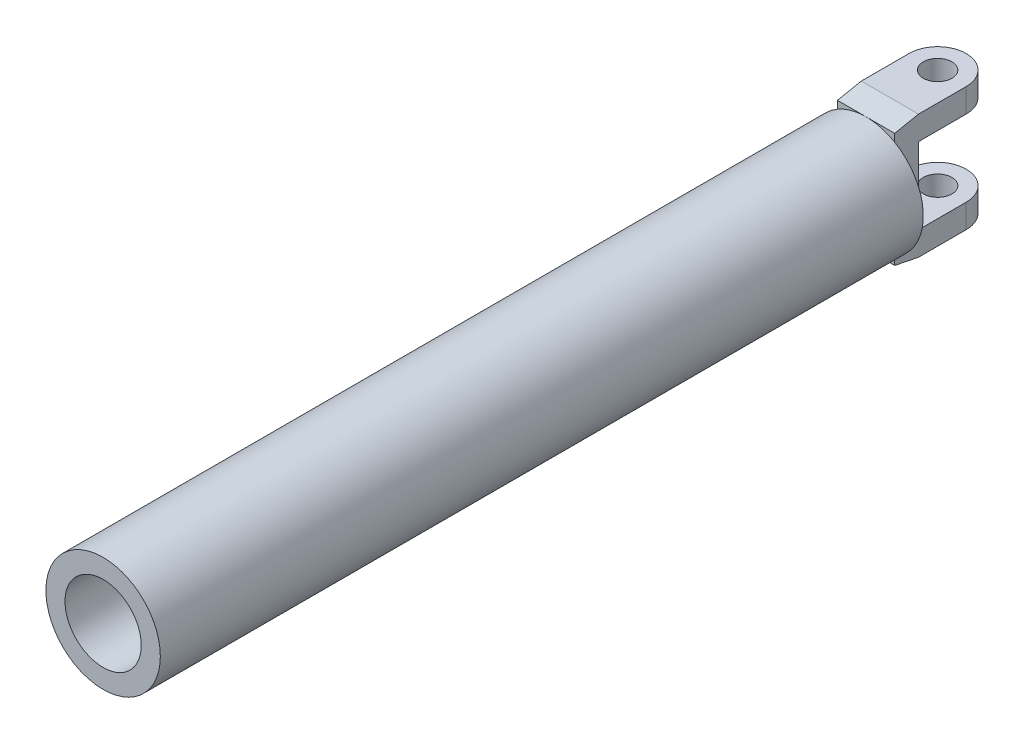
ISO-10303-21;
HEADER;
FILE_DESCRIPTION(('STEP AP214'),'2;1');
FILE_NAME('part.step','',(''),(''),'','','');
FILE_SCHEMA(('AUTOMOTIVE_DESIGN { 1 0 10303 214 1 1 1 1 }'));
ENDSEC;
DATA;
#1=APPLICATION_CONTEXT('core data for automotive mechanical design processes');
#2=APPLICATION_PROTOCOL_DEFINITION('international standard','automotive_design',2000,#1);
#3=PRODUCT_CONTEXT('',#1,'mechanical');
#4=PRODUCT('Part','Part','',(#3));
#5=PRODUCT_RELATED_PRODUCT_CATEGORY('part','',(#4));
#6=PRODUCT_DEFINITION_FORMATION('','',#4);
#7=PRODUCT_DEFINITION_CONTEXT('part definition',#1,'design');
#8=PRODUCT_DEFINITION('design','',#6,#7);
#9=PRODUCT_DEFINITION_SHAPE('','',#8);
#10=(LENGTH_UNIT() NAMED_UNIT(*) SI_UNIT(.MILLI.,.METRE.));
#11=(NAMED_UNIT(*) PLANE_ANGLE_UNIT() SI_UNIT($,.RADIAN.));
#12=(NAMED_UNIT(*) SI_UNIT($,.STERADIAN.) SOLID_ANGLE_UNIT());
#13=UNCERTAINTY_MEASURE_WITH_UNIT(LENGTH_MEASURE(1.E-05),#10,'distance_accuracy_value','');
#14=(GEOMETRIC_REPRESENTATION_CONTEXT(3) GLOBAL_UNCERTAINTY_ASSIGNED_CONTEXT((#13)) GLOBAL_UNIT_ASSIGNED_CONTEXT((#10,
#11,#12)) REPRESENTATION_CONTEXT('',''));
#15=CARTESIAN_POINT('',(0.,0.,0.));
#16=DIRECTION('',(0.,0.,1.));
#17=DIRECTION('',(1.,0.,0.));
#18=AXIS2_PLACEMENT_3D('',#15,#16,#17);
#19=CARTESIAN_POINT('',(0.,0.,0.));
#20=DIRECTION('',(0.,0.,1.));
#21=DIRECTION('',(1.,0.,0.));
#22=AXIS2_PLACEMENT_3D('',#19,#20,#21);
#23=PLANE('',#22);
#24=DIRECTION('',(0.,-1.,0.));
#25=VECTOR('',#24,1.);
#26=CARTESIAN_POINT('',(30.,-60.,0.));
#27=LINE('',#26,#25);
#28=CARTESIAN_POINT('',(30.,51.9615242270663,0.));
#29=VERTEX_POINT('',#28);
#30=CARTESIAN_POINT('',(30.,-51.9615242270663,0.));
#31=VERTEX_POINT('',#30);
#32=EDGE_CURVE('E173',#29,#31,#27,.T.);
#33=ORIENTED_EDGE('',*,*,#32,.F.);
#34=CARTESIAN_POINT('',(0.,0.,0.));
#35=DIRECTION('',(0.,0.,1.));
#36=DIRECTION('',(1.,0.,0.));
#37=AXIS2_PLACEMENT_3D('',#34,#35,#36);
#38=CIRCLE('',#37,60.);
#39=EDGE_CURVE('E188',#31,#29,#38,.T.);
#40=ORIENTED_EDGE('',*,*,#39,.F.);
#41=EDGE_LOOP('',(#33,#40));
#42=FACE_BOUND('',#41,.T.);
#43=ADVANCED_FACE('F41',(#42),#23,.F.);
#44=CARTESIAN_POINT('',(0.,0.,800.));
#45=DIRECTION('',(0.,0.,-1.));
#46=DIRECTION('',(-1.,0.,0.));
#47=AXIS2_PLACEMENT_3D('',#44,#45,#46);
#48=CYLINDRICAL_SURFACE('',#47,60.);
#49=CARTESIAN_POINT('',(0.,0.,800.));
#50=DIRECTION('',(0.,0.,1.));
#51=DIRECTION('',(1.,0.,0.));
#52=AXIS2_PLACEMENT_3D('',#49,#50,#51);
#53=CIRCLE('',#52,60.);
#54=CARTESIAN_POINT('',(60.,0.,800.));
#55=VERTEX_POINT('',#54);
#56=EDGE_CURVE('E197',#55,#55,#53,.T.);
#57=ORIENTED_EDGE('',*,*,#56,.F.);
#58=EDGE_LOOP('',(#57));
#59=FACE_BOUND('',#58,.T.);
#60=CARTESIAN_POINT('',(0.,60.,0.));
#61=VERTEX_POINT('',#60);
#62=EDGE_CURVE('E167',#29,#61,#38,.T.);
#63=ORIENTED_EDGE('',*,*,#62,.T.);
#64=CARTESIAN_POINT('',(-30.,51.9615242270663,0.));
#65=VERTEX_POINT('',#64);
#66=EDGE_CURVE('E200',#61,#65,#38,.T.);
#67=ORIENTED_EDGE('',*,*,#66,.T.);
#68=CARTESIAN_POINT('',(-30.,-51.9615242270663,0.));
#69=VERTEX_POINT('',#68);
#70=EDGE_CURVE('E372',#65,#69,#38,.T.);
#71=ORIENTED_EDGE('',*,*,#70,.T.);
#72=CARTESIAN_POINT('',(0.,-60.,0.));
#73=VERTEX_POINT('',#72);
#74=EDGE_CURVE('E322',#69,#73,#38,.T.);
#75=ORIENTED_EDGE('',*,*,#74,.T.);
#76=EDGE_CURVE('E191',#73,#31,#38,.T.);
#77=ORIENTED_EDGE('',*,*,#76,.T.);
#78=ORIENTED_EDGE('',*,*,#39,.T.);
#79=EDGE_LOOP('',(#63,#67,#71,#75,#77,#78));
#80=FACE_BOUND('',#79,.T.);
#81=ADVANCED_FACE('F373',(#59,#80),#48,.T.);
#82=CARTESIAN_POINT('',(0.,0.,800.));
#83=DIRECTION('',(0.,0.,1.));
#84=DIRECTION('',(1.,0.,0.));
#85=AXIS2_PLACEMENT_3D('',#82,#83,#84);
#86=PLANE('',#85);
#87=CARTESIAN_POINT('',(0.,0.,800.));
#88=DIRECTION('',(0.,0.,1.));
#89=DIRECTION('',(1.,0.,0.));
#90=AXIS2_PLACEMENT_3D('',#87,#88,#89);
#91=CIRCLE('',#90,40.);
#92=CARTESIAN_POINT('',(40.,0.,800.));
#93=VERTEX_POINT('',#92);
#94=EDGE_CURVE('E237',#93,#93,#91,.T.);
#95=ORIENTED_EDGE('',*,*,#94,.F.);
#96=EDGE_LOOP('',(#95));
#97=FACE_BOUND('',#96,.T.);
#98=ORIENTED_EDGE('',*,*,#56,.T.);
#99=EDGE_LOOP('',(#98));
#100=FACE_BOUND('',#99,.T.);
#101=ADVANCED_FACE('F375',(#97,#100),#86,.T.);
#102=ORIENTED_EDGE('',*,*,#70,.F.);
#103=DIRECTION('',(0.,-1.,0.));
#104=VECTOR('',#103,1.);
#105=CARTESIAN_POINT('',(-30.,-60.,0.));
#106=LINE('',#105,#104);
#107=EDGE_CURVE('E204',#65,#69,#106,.T.);
#108=ORIENTED_EDGE('',*,*,#107,.T.);
#109=EDGE_LOOP('',(#102,#108));
#110=FACE_BOUND('',#109,.T.);
#111=ADVANCED_FACE('F382',(#110),#23,.F.);
#112=CARTESIAN_POINT('',(30.,-60.,0.));
#113=DIRECTION('',(0.,0.,-1.));
#114=DIRECTION('',(-1.,0.,0.));
#115=AXIS2_PLACEMENT_3D('',#112,#113,#114);
#116=PLANE('',#115);
#117=ORIENTED_EDGE('',*,*,#62,.F.);
#118=CARTESIAN_POINT('',(30.,60.,0.));
#119=VERTEX_POINT('',#118);
#120=EDGE_CURVE('E162',#119,#29,#27,.T.);
#121=ORIENTED_EDGE('',*,*,#120,.F.);
#122=DIRECTION('',(-1.,0.,0.));
#123=VECTOR('',#122,1.);
#124=CARTESIAN_POINT('',(30.,60.,0.));
#125=LINE('',#124,#123);
#126=EDGE_CURVE('E166',#119,#61,#125,.T.);
#127=ORIENTED_EDGE('',*,*,#126,.T.);
#128=EDGE_LOOP('',(#117,#121,#127));
#129=FACE_BOUND('',#128,.T.);
#130=ADVANCED_FACE('F164',(#129),#116,.F.);
#131=ORIENTED_EDGE('',*,*,#66,.F.);
#132=CARTESIAN_POINT('',(-30.,60.,0.));
#133=VERTEX_POINT('',#132);
#134=EDGE_CURVE('E187',#61,#133,#125,.T.);
#135=ORIENTED_EDGE('',*,*,#134,.T.);
#136=EDGE_CURVE('E271',#133,#65,#106,.T.);
#137=ORIENTED_EDGE('',*,*,#136,.T.);
#138=EDGE_LOOP('',(#131,#135,#137));
#139=FACE_BOUND('',#138,.T.);
#140=ADVANCED_FACE('F369',(#139),#116,.F.);
#141=ORIENTED_EDGE('',*,*,#74,.F.);
#142=CARTESIAN_POINT('',(-30.,-60.,0.));
#143=VERTEX_POINT('',#142);
#144=EDGE_CURVE('E270',#69,#143,#106,.T.);
#145=ORIENTED_EDGE('',*,*,#144,.T.);
#146=DIRECTION('',(-1.,0.,0.));
#147=VECTOR('',#146,1.);
#148=CARTESIAN_POINT('',(30.,-60.,0.));
#149=LINE('',#148,#147);
#150=EDGE_CURVE('E304',#73,#143,#149,.T.);
#151=ORIENTED_EDGE('',*,*,#150,.F.);
#152=EDGE_LOOP('',(#141,#145,#151));
#153=FACE_BOUND('',#152,.T.);
#154=ADVANCED_FACE('F325',(#153),#116,.F.);
#155=CARTESIAN_POINT('',(30.,60.,0.));
#156=DIRECTION('',(0.,-0.98058067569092,-0.196116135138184));
#157=DIRECTION('',(0.,0.196116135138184,-0.98058067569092));
#158=AXIS2_PLACEMENT_3D('',#155,#156,#157);
#159=PLANE('',#158);
#160=DIRECTION('',(0.,-0.196116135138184,0.98058067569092));
#161=VECTOR('',#160,1.);
#162=CARTESIAN_POINT('',(-30.,60.,0.));
#163=LINE('',#162,#161);
#164=CARTESIAN_POINT('',(-30.,65.,-25.));
#165=VERTEX_POINT('',#164);
#166=EDGE_CURVE('E251',#165,#133,#163,.T.);
#167=ORIENTED_EDGE('',*,*,#166,.T.);
#168=ORIENTED_EDGE('',*,*,#134,.F.);
#169=ORIENTED_EDGE('',*,*,#126,.F.);
#170=DIRECTION('',(0.,-0.196116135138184,0.98058067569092));
#171=VECTOR('',#170,1.);
#172=CARTESIAN_POINT('',(30.,60.,0.));
#173=LINE('',#172,#171);
#174=CARTESIAN_POINT('',(30.,65.,-25.));
#175=VERTEX_POINT('',#174);
#176=EDGE_CURVE('E175',#175,#119,#173,.T.);
#177=ORIENTED_EDGE('',*,*,#176,.F.);
#178=DIRECTION('',(-1.,0.,0.));
#179=VECTOR('',#178,1.);
#180=CARTESIAN_POINT('',(30.,65.,-25.));
#181=LINE('',#180,#179);
#182=EDGE_CURVE('E268',#175,#165,#181,.T.);
#183=ORIENTED_EDGE('',*,*,#182,.T.);
#184=EDGE_LOOP('',(#167,#168,#169,#177,#183));
#185=FACE_BOUND('',#184,.T.);
#186=ADVANCED_FACE('F186',(#185),#159,.F.);
#187=ORIENTED_EDGE('',*,*,#76,.F.);
#188=CARTESIAN_POINT('',(30.,-60.,0.));
#189=VERTEX_POINT('',#188);
#190=EDGE_CURVE('E193',#189,#73,#149,.T.);
#191=ORIENTED_EDGE('',*,*,#190,.F.);
#192=EDGE_CURVE('E171',#31,#189,#27,.T.);
#193=ORIENTED_EDGE('',*,*,#192,.F.);
#194=EDGE_LOOP('',(#187,#191,#193));
#195=FACE_BOUND('',#194,.T.);
#196=ADVANCED_FACE('F319',(#195),#116,.F.);
#197=CARTESIAN_POINT('',(30.,-60.,0.));
#198=DIRECTION('',(0.,0.98058067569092,-0.196116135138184));
#199=DIRECTION('',(0.,0.196116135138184,0.98058067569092));
#200=AXIS2_PLACEMENT_3D('',#197,#198,#199);
#201=PLANE('',#200);
#202=DIRECTION('',(0.,-0.196116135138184,-0.98058067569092));
#203=VECTOR('',#202,1.);
#204=CARTESIAN_POINT('',(-30.,-60.,0.));
#205=LINE('',#204,#203);
#206=CARTESIAN_POINT('',(-30.,-65.,-25.));
#207=VERTEX_POINT('',#206);
#208=EDGE_CURVE('E274',#143,#207,#205,.T.);
#209=ORIENTED_EDGE('',*,*,#208,.T.);
#210=DIRECTION('',(-1.,0.,0.));
#211=VECTOR('',#210,1.);
#212=CARTESIAN_POINT('',(30.,-65.,-25.));
#213=LINE('',#212,#211);
#214=CARTESIAN_POINT('',(30.,-65.,-25.));
#215=VERTEX_POINT('',#214);
#216=EDGE_CURVE('E302',#215,#207,#213,.T.);
#217=ORIENTED_EDGE('',*,*,#216,.F.);
#218=DIRECTION('',(0.,-0.196116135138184,-0.98058067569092));
#219=VECTOR('',#218,1.);
#220=CARTESIAN_POINT('',(30.,-60.,0.));
#221=LINE('',#220,#219);
#222=EDGE_CURVE('E170',#189,#215,#221,.T.);
#223=ORIENTED_EDGE('',*,*,#222,.F.);
#224=ORIENTED_EDGE('',*,*,#190,.T.);
#225=ORIENTED_EDGE('',*,*,#150,.T.);
#226=EDGE_LOOP('',(#209,#217,#223,#224,#225));
#227=FACE_BOUND('',#226,.T.);
#228=ADVANCED_FACE('F315',(#227),#201,.F.);
#229=CARTESIAN_POINT('',(30.,-65.,-25.));
#230=DIRECTION('',(0.,1.,0.));
#231=DIRECTION('',(0.,0.,1.));
#232=AXIS2_PLACEMENT_3D('',#229,#230,#231);
#233=PLANE('',#232);
#234=CARTESIAN_POINT('',(0.,-65.,-75.));
#235=DIRECTION('',(0.,1.,0.));
#236=DIRECTION('',(0.,0.,1.));
#237=AXIS2_PLACEMENT_3D('',#234,#235,#236);
#238=CIRCLE('',#237,15.);
#239=CARTESIAN_POINT('',(0.,-65.,-60.));
#240=VERTEX_POINT('',#239);
#241=EDGE_CURVE('E230',#240,#240,#238,.T.);
#242=ORIENTED_EDGE('',*,*,#241,.T.);
#243=EDGE_LOOP('',(#242));
#244=FACE_BOUND('',#243,.T.);
#245=DIRECTION('',(0.,0.,-1.));
#246=VECTOR('',#245,1.);
#247=CARTESIAN_POINT('',(-30.,-65.,-25.));
#248=LINE('',#247,#246);
#249=CARTESIAN_POINT('',(-30.,-65.,-75.));
#250=VERTEX_POINT('',#249);
#251=EDGE_CURVE('E276',#207,#250,#248,.T.);
#252=ORIENTED_EDGE('',*,*,#251,.T.);
#253=CARTESIAN_POINT('',(0.,-65.,-75.));
#254=DIRECTION('',(0.,1.,0.));
#255=DIRECTION('',(0.,0.,1.));
#256=AXIS2_PLACEMENT_3D('',#253,#254,#255);
#257=CIRCLE('',#256,30.);
#258=CARTESIAN_POINT('',(0.,-65.,-105.));
#259=VERTEX_POINT('',#258);
#260=EDGE_CURVE('E214',#250,#259,#257,.F.);
#261=ORIENTED_EDGE('',*,*,#260,.T.);
#262=CARTESIAN_POINT('',(0.,-65.,-75.));
#263=DIRECTION('',(0.,1.,0.));
#264=DIRECTION('',(0.,0.,1.));
#265=AXIS2_PLACEMENT_3D('',#262,#263,#264);
#266=CIRCLE('',#265,30.);
#267=CARTESIAN_POINT('',(30.,-65.,-75.));
#268=VERTEX_POINT('',#267);
#269=EDGE_CURVE('E212',#259,#268,#266,.F.);
#270=ORIENTED_EDGE('',*,*,#269,.T.);
#271=DIRECTION('',(0.,0.,-1.));
#272=VECTOR('',#271,1.);
#273=CARTESIAN_POINT('',(30.,-65.,-25.));
#274=LINE('',#273,#272);
#275=EDGE_CURVE('E254',#215,#268,#274,.T.);
#276=ORIENTED_EDGE('',*,*,#275,.F.);
#277=ORIENTED_EDGE('',*,*,#216,.T.);
#278=EDGE_LOOP('',(#252,#261,#270,#276,#277));
#279=FACE_BOUND('',#278,.T.);
#280=ADVANCED_FACE('F332',(#244,#279),#233,.F.);
#281=CARTESIAN_POINT('',(30.,-40.,-105.));
#282=DIRECTION('',(0.,-1.,0.));
#283=DIRECTION('',(0.,0.,-1.));
#284=AXIS2_PLACEMENT_3D('',#281,#282,#283);
#285=PLANE('',#284);
#286=CARTESIAN_POINT('',(0.,-40.,-75.));
#287=DIRECTION('',(0.,-1.,0.));
#288=DIRECTION('',(0.,0.,-1.));
#289=AXIS2_PLACEMENT_3D('',#286,#287,#288);
#290=CIRCLE('',#289,15.);
#291=CARTESIAN_POINT('',(0.,-40.,-90.));
#292=VERTEX_POINT('',#291);
#293=EDGE_CURVE('E249',#292,#292,#290,.T.);
#294=ORIENTED_EDGE('',*,*,#293,.T.);
#295=EDGE_LOOP('',(#294));
#296=FACE_BOUND('',#295,.T.);
#297=CARTESIAN_POINT('',(0.,-40.,-75.));
#298=DIRECTION('',(0.,-1.,0.));
#299=DIRECTION('',(0.,0.,-1.));
#300=AXIS2_PLACEMENT_3D('',#297,#298,#299);
#301=CIRCLE('',#300,30.);
#302=CARTESIAN_POINT('',(30.,-40.,-75.));
#303=VERTEX_POINT('',#302);
#304=CARTESIAN_POINT('',(0.,-40.,-105.));
#305=VERTEX_POINT('',#304);
#306=EDGE_CURVE('E201',#303,#305,#301,.F.);
#307=ORIENTED_EDGE('',*,*,#306,.T.);
#308=CARTESIAN_POINT('',(0.,-40.,-75.));
#309=DIRECTION('',(0.,-1.,0.));
#310=DIRECTION('',(0.,0.,-1.));
#311=AXIS2_PLACEMENT_3D('',#308,#309,#310);
#312=CIRCLE('',#311,30.);
#313=CARTESIAN_POINT('',(-30.,-40.,-75.));
#314=VERTEX_POINT('',#313);
#315=EDGE_CURVE('E203',#305,#314,#312,.F.);
#316=ORIENTED_EDGE('',*,*,#315,.T.);
#317=DIRECTION('',(0.,0.,1.));
#318=VECTOR('',#317,1.);
#319=CARTESIAN_POINT('',(-30.,-40.,-105.));
#320=LINE('',#319,#318);
#321=CARTESIAN_POINT('',(-30.,-40.,-27.4754878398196));
#322=VERTEX_POINT('',#321);
#323=EDGE_CURVE('E279',#314,#322,#320,.T.);
#324=ORIENTED_EDGE('',*,*,#323,.T.);
#325=DIRECTION('',(-1.,0.,0.));
#326=VECTOR('',#325,1.);
#327=CARTESIAN_POINT('',(30.,-40.,-27.4754878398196));
#328=LINE('',#327,#326);
#329=CARTESIAN_POINT('',(30.,-40.,-27.4754878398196));
#330=VERTEX_POINT('',#329);
#331=EDGE_CURVE('E300',#330,#322,#328,.T.);
#332=ORIENTED_EDGE('',*,*,#331,.F.);
#333=DIRECTION('',(0.,0.,1.));
#334=VECTOR('',#333,1.);
#335=CARTESIAN_POINT('',(30.,-40.,-105.));
#336=LINE('',#335,#334);
#337=EDGE_CURVE('E256',#303,#330,#336,.T.);
#338=ORIENTED_EDGE('',*,*,#337,.F.);
#339=EDGE_LOOP('',(#307,#316,#324,#332,#338));
#340=FACE_BOUND('',#339,.T.);
#341=ADVANCED_FACE('F340',(#296,#340),#285,.F.);
#342=CARTESIAN_POINT('',(30.,-40.,-27.4754878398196));
#343=DIRECTION('',(0.,-0.98058067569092,0.196116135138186));
#344=DIRECTION('',(0.,-0.196116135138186,-0.98058067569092));
#345=AXIS2_PLACEMENT_3D('',#342,#343,#344);
#346=PLANE('',#345);
#347=DIRECTION('',(0.,0.196116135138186,0.98058067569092));
#348=VECTOR('',#347,1.);
#349=CARTESIAN_POINT('',(-30.,-40.,-27.4754878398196));
#350=LINE('',#349,#348);
#351=CARTESIAN_POINT('',(-30.,-39.5049024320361,-25.));
#352=VERTEX_POINT('',#351);
#353=EDGE_CURVE('E281',#322,#352,#350,.T.);
#354=ORIENTED_EDGE('',*,*,#353,.T.);
#355=DIRECTION('',(-1.,0.,0.));
#356=VECTOR('',#355,1.);
#357=CARTESIAN_POINT('',(30.,-39.5049024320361,-25.));
#358=LINE('',#357,#356);
#359=CARTESIAN_POINT('',(30.,-39.5049024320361,-25.));
#360=VERTEX_POINT('',#359);
#361=EDGE_CURVE('E297',#360,#352,#358,.T.);
#362=ORIENTED_EDGE('',*,*,#361,.F.);
#363=DIRECTION('',(0.,0.196116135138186,0.98058067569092));
#364=VECTOR('',#363,1.);
#365=CARTESIAN_POINT('',(30.,-40.,-27.4754878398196));
#366=LINE('',#365,#364);
#367=EDGE_CURVE('E258',#330,#360,#366,.T.);
#368=ORIENTED_EDGE('',*,*,#367,.F.);
#369=ORIENTED_EDGE('',*,*,#331,.T.);
#370=EDGE_LOOP('',(#354,#362,#368,#369));
#371=FACE_BOUND('',#370,.T.);
#372=ADVANCED_FACE('F347',(#371),#346,.F.);
#373=CARTESIAN_POINT('',(30.,39.5049024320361,-25.));
#374=DIRECTION('',(0.,0.,1.));
#375=DIRECTION('',(1.,0.,0.));
#376=AXIS2_PLACEMENT_3D('',#373,#374,#375);
#377=PLANE('',#376);
#378=DIRECTION('',(0.,1.,0.));
#379=VECTOR('',#378,1.);
#380=CARTESIAN_POINT('',(-30.,39.5049024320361,-25.));
#381=LINE('',#380,#379);
#382=CARTESIAN_POINT('',(-30.,39.5049024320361,-25.));
#383=VERTEX_POINT('',#382);
#384=EDGE_CURVE('E283',#352,#383,#381,.T.);
#385=ORIENTED_EDGE('',*,*,#384,.T.);
#386=DIRECTION('',(-1.,0.,0.));
#387=VECTOR('',#386,1.);
#388=CARTESIAN_POINT('',(30.,39.5049024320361,-25.));
#389=LINE('',#388,#387);
#390=CARTESIAN_POINT('',(30.,39.5049024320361,-25.));
#391=VERTEX_POINT('',#390);
#392=EDGE_CURVE('E294',#391,#383,#389,.T.);
#393=ORIENTED_EDGE('',*,*,#392,.F.);
#394=DIRECTION('',(0.,1.,0.));
#395=VECTOR('',#394,1.);
#396=CARTESIAN_POINT('',(30.,39.5049024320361,-25.));
#397=LINE('',#396,#395);
#398=EDGE_CURVE('E260',#360,#391,#397,.T.);
#399=ORIENTED_EDGE('',*,*,#398,.F.);
#400=ORIENTED_EDGE('',*,*,#361,.T.);
#401=EDGE_LOOP('',(#385,#393,#399,#400));
#402=FACE_BOUND('',#401,.T.);
#403=ADVANCED_FACE('F351',(#402),#377,.F.);
#404=CARTESIAN_POINT('',(30.,40.,-27.4754878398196));
#405=DIRECTION('',(0.,0.98058067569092,0.196116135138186));
#406=DIRECTION('',(0.,-0.196116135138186,0.98058067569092));
#407=AXIS2_PLACEMENT_3D('',#404,#405,#406);
#408=PLANE('',#407);
#409=DIRECTION('',(0.,0.196116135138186,-0.98058067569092));
#410=VECTOR('',#409,1.);
#411=CARTESIAN_POINT('',(-30.,40.,-27.4754878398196));
#412=LINE('',#411,#410);
#413=CARTESIAN_POINT('',(-30.,40.,-27.4754878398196));
#414=VERTEX_POINT('',#413);
#415=EDGE_CURVE('E285',#383,#414,#412,.T.);
#416=ORIENTED_EDGE('',*,*,#415,.T.);
#417=DIRECTION('',(-1.,0.,0.));
#418=VECTOR('',#417,1.);
#419=CARTESIAN_POINT('',(30.,40.,-27.4754878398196));
#420=LINE('',#419,#418);
#421=CARTESIAN_POINT('',(30.,40.,-27.4754878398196));
#422=VERTEX_POINT('',#421);
#423=EDGE_CURVE('E291',#422,#414,#420,.T.);
#424=ORIENTED_EDGE('',*,*,#423,.F.);
#425=DIRECTION('',(0.,0.196116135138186,-0.98058067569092));
#426=VECTOR('',#425,1.);
#427=CARTESIAN_POINT('',(30.,40.,-27.4754878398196));
#428=LINE('',#427,#426);
#429=EDGE_CURVE('E262',#391,#422,#428,.T.);
#430=ORIENTED_EDGE('',*,*,#429,.F.);
#431=ORIENTED_EDGE('',*,*,#392,.T.);
#432=EDGE_LOOP('',(#416,#424,#430,#431));
#433=FACE_BOUND('',#432,.T.);
#434=ADVANCED_FACE('F356',(#433),#408,.F.);
#435=CARTESIAN_POINT('',(30.,40.,-105.));
#436=DIRECTION('',(0.,1.,0.));
#437=DIRECTION('',(0.,0.,1.));
#438=AXIS2_PLACEMENT_3D('',#435,#436,#437);
#439=PLANE('',#438);
#440=CARTESIAN_POINT('',(0.,40.,-75.));
#441=DIRECTION('',(0.,1.,0.));
#442=DIRECTION('',(0.,0.,1.));
#443=AXIS2_PLACEMENT_3D('',#440,#441,#442);
#444=CIRCLE('',#443,15.);
#445=CARTESIAN_POINT('',(0.,40.,-60.));
#446=VERTEX_POINT('',#445);
#447=EDGE_CURVE('E246',#446,#446,#444,.T.);
#448=ORIENTED_EDGE('',*,*,#447,.T.);
#449=EDGE_LOOP('',(#448));
#450=FACE_BOUND('',#449,.T.);
#451=DIRECTION('',(0.,0.,-1.));
#452=VECTOR('',#451,1.);
#453=CARTESIAN_POINT('',(-30.,40.,-105.));
#454=LINE('',#453,#452);
#455=CARTESIAN_POINT('',(-30.,40.,-75.));
#456=VERTEX_POINT('',#455);
#457=EDGE_CURVE('E287',#414,#456,#454,.T.);
#458=ORIENTED_EDGE('',*,*,#457,.T.);
#459=CARTESIAN_POINT('',(0.,40.,-75.));
#460=DIRECTION('',(0.,1.,0.));
#461=DIRECTION('',(0.,0.,1.));
#462=AXIS2_PLACEMENT_3D('',#459,#460,#461);
#463=CIRCLE('',#462,30.);
#464=CARTESIAN_POINT('',(0.,40.,-105.));
#465=VERTEX_POINT('',#464);
#466=EDGE_CURVE('E11',#456,#465,#463,.F.);
#467=ORIENTED_EDGE('',*,*,#466,.T.);
#468=CARTESIAN_POINT('',(0.,40.,-75.));
#469=DIRECTION('',(0.,1.,0.));
#470=DIRECTION('',(0.,0.,1.));
#471=AXIS2_PLACEMENT_3D('',#468,#469,#470);
#472=CIRCLE('',#471,30.);
#473=CARTESIAN_POINT('',(30.,40.,-75.));
#474=VERTEX_POINT('',#473);
#475=EDGE_CURVE('E50',#465,#474,#472,.F.);
#476=ORIENTED_EDGE('',*,*,#475,.T.);
#477=DIRECTION('',(0.,0.,-1.));
#478=VECTOR('',#477,1.);
#479=CARTESIAN_POINT('',(30.,40.,-105.));
#480=LINE('',#479,#478);
#481=EDGE_CURVE('E264',#422,#474,#480,.T.);
#482=ORIENTED_EDGE('',*,*,#481,.F.);
#483=ORIENTED_EDGE('',*,*,#423,.T.);
#484=EDGE_LOOP('',(#458,#467,#476,#482,#483));
#485=FACE_BOUND('',#484,.T.);
#486=ADVANCED_FACE('F447',(#450,#485),#439,.F.);
#487=CARTESIAN_POINT('',(30.,65.,-25.));
#488=DIRECTION('',(0.,-1.,0.));
#489=DIRECTION('',(0.,0.,-1.));
#490=AXIS2_PLACEMENT_3D('',#487,#488,#489);
#491=PLANE('',#490);
#492=CARTESIAN_POINT('',(0.,65.,-75.));
#493=DIRECTION('',(0.,1.,0.));
#494=DIRECTION('',(0.,0.,1.));
#495=AXIS2_PLACEMENT_3D('',#492,#493,#494);
#496=CIRCLE('',#495,15.);
#497=CARTESIAN_POINT('',(0.,65.,-60.));
#498=VERTEX_POINT('',#497);
#499=EDGE_CURVE('E225',#498,#498,#496,.T.);
#500=ORIENTED_EDGE('',*,*,#499,.F.);
#501=EDGE_LOOP('',(#500));
#502=FACE_BOUND('',#501,.T.);
#503=CARTESIAN_POINT('',(0.,65.,-75.));
#504=DIRECTION('',(0.,-1.,0.));
#505=DIRECTION('',(0.,0.,-1.));
#506=AXIS2_PLACEMENT_3D('',#503,#504,#505);
#507=CIRCLE('',#506,30.);
#508=CARTESIAN_POINT('',(30.,65.,-75.));
#509=VERTEX_POINT('',#508);
#510=CARTESIAN_POINT('',(0.,65.,-105.));
#511=VERTEX_POINT('',#510);
#512=EDGE_CURVE('E64',#509,#511,#507,.F.);
#513=ORIENTED_EDGE('',*,*,#512,.T.);
#514=CARTESIAN_POINT('',(0.,65.,-75.));
#515=DIRECTION('',(0.,-1.,0.));
#516=DIRECTION('',(0.,0.,-1.));
#517=AXIS2_PLACEMENT_3D('',#514,#515,#516);
#518=CIRCLE('',#517,30.);
#519=CARTESIAN_POINT('',(-30.,65.,-75.));
#520=VERTEX_POINT('',#519);
#521=EDGE_CURVE('E221',#511,#520,#518,.F.);
#522=ORIENTED_EDGE('',*,*,#521,.T.);
#523=DIRECTION('',(0.,0.,1.));
#524=VECTOR('',#523,1.);
#525=CARTESIAN_POINT('',(-30.,65.,-25.));
#526=LINE('',#525,#524);
#527=EDGE_CURVE('E182',#520,#165,#526,.T.);
#528=ORIENTED_EDGE('',*,*,#527,.T.);
#529=ORIENTED_EDGE('',*,*,#182,.F.);
#530=DIRECTION('',(0.,0.,1.));
#531=VECTOR('',#530,1.);
#532=CARTESIAN_POINT('',(30.,65.,-25.));
#533=LINE('',#532,#531);
#534=EDGE_CURVE('E178',#509,#175,#533,.T.);
#535=ORIENTED_EDGE('',*,*,#534,.F.);
#536=EDGE_LOOP('',(#513,#522,#528,#529,#535));
#537=FACE_BOUND('',#536,.T.);
#538=ADVANCED_FACE('F363',(#502,#537),#491,.F.);
#539=CARTESIAN_POINT('',(30.,0.,0.));
#540=DIRECTION('',(-1.,0.,0.));
#541=DIRECTION('',(0.,0.,1.));
#542=AXIS2_PLACEMENT_3D('',#539,#540,#541);
#543=PLANE('',#542);
#544=ORIENTED_EDGE('',*,*,#275,.T.);
#545=DIRECTION('',(0.,1.,0.));
#546=VECTOR('',#545,1.);
#547=CARTESIAN_POINT('',(30.,0.,-75.));
#548=LINE('',#547,#546);
#549=EDGE_CURVE('E218',#268,#303,#548,.T.);
#550=ORIENTED_EDGE('',*,*,#549,.T.);
#551=ORIENTED_EDGE('',*,*,#337,.T.);
#552=ORIENTED_EDGE('',*,*,#367,.T.);
#553=ORIENTED_EDGE('',*,*,#398,.T.);
#554=ORIENTED_EDGE('',*,*,#429,.T.);
#555=ORIENTED_EDGE('',*,*,#481,.T.);
#556=DIRECTION('',(0.,1.,0.));
#557=VECTOR('',#556,1.);
#558=CARTESIAN_POINT('',(30.,0.,-75.));
#559=LINE('',#558,#557);
#560=EDGE_CURVE('E216',#474,#509,#559,.T.);
#561=ORIENTED_EDGE('',*,*,#560,.T.);
#562=ORIENTED_EDGE('',*,*,#534,.T.);
#563=ORIENTED_EDGE('',*,*,#176,.T.);
#564=ORIENTED_EDGE('',*,*,#120,.T.);
#565=ORIENTED_EDGE('',*,*,#32,.T.);
#566=ORIENTED_EDGE('',*,*,#192,.T.);
#567=ORIENTED_EDGE('',*,*,#222,.T.);
#568=EDGE_LOOP('',(#544,#550,#551,#552,#553,#554,#555,#561,#562,#563,#564,#565,#566,#567));
#569=FACE_BOUND('',#568,.T.);
#570=ADVANCED_FACE('F177',(#569),#543,.F.);
#571=CARTESIAN_POINT('',(-30.,0.,0.));
#572=DIRECTION('',(-1.,0.,0.));
#573=DIRECTION('',(0.,0.,1.));
#574=AXIS2_PLACEMENT_3D('',#571,#572,#573);
#575=PLANE('',#574);
#576=ORIENTED_EDGE('',*,*,#323,.F.);
#577=DIRECTION('',(0.,1.,0.));
#578=VECTOR('',#577,1.);
#579=CARTESIAN_POINT('',(-30.,-65.,-75.));
#580=LINE('',#579,#578);
#581=EDGE_CURVE('E209',#314,#250,#580,.F.);
#582=ORIENTED_EDGE('',*,*,#581,.T.);
#583=ORIENTED_EDGE('',*,*,#251,.F.);
#584=ORIENTED_EDGE('',*,*,#208,.F.);
#585=ORIENTED_EDGE('',*,*,#144,.F.);
#586=ORIENTED_EDGE('',*,*,#107,.F.);
#587=ORIENTED_EDGE('',*,*,#136,.F.);
#588=ORIENTED_EDGE('',*,*,#166,.F.);
#589=ORIENTED_EDGE('',*,*,#527,.F.);
#590=DIRECTION('',(0.,1.,0.));
#591=VECTOR('',#590,1.);
#592=CARTESIAN_POINT('',(-30.,40.,-75.));
#593=LINE('',#592,#591);
#594=EDGE_CURVE('E206',#520,#456,#593,.F.);
#595=ORIENTED_EDGE('',*,*,#594,.T.);
#596=ORIENTED_EDGE('',*,*,#457,.F.);
#597=ORIENTED_EDGE('',*,*,#415,.F.);
#598=ORIENTED_EDGE('',*,*,#384,.F.);
#599=ORIENTED_EDGE('',*,*,#353,.F.);
#600=EDGE_LOOP('',(#576,#582,#583,#584,#585,#586,#587,#588,#589,#595,#596,#597,#598,#599));
#601=FACE_BOUND('',#600,.T.);
#602=ADVANCED_FACE('F331',(#601),#575,.T.);
#603=CARTESIAN_POINT('',(0.,-65.,-75.));
#604=DIRECTION('',(0.,1.,0.));
#605=DIRECTION('',(0.,0.,1.));
#606=AXIS2_PLACEMENT_3D('',#603,#604,#605);
#607=CYLINDRICAL_SURFACE('',#606,15.);
#608=ORIENTED_EDGE('',*,*,#499,.T.);
#609=EDGE_LOOP('',(#608));
#610=FACE_BOUND('',#609,.T.);
#611=ORIENTED_EDGE('',*,*,#447,.F.);
#612=EDGE_LOOP('',(#611));
#613=FACE_BOUND('',#612,.T.);
#614=ADVANCED_FACE('F420',(#610,#613),#607,.F.);
#615=ORIENTED_EDGE('',*,*,#241,.F.);
#616=EDGE_LOOP('',(#615));
#617=FACE_BOUND('',#616,.T.);
#618=ORIENTED_EDGE('',*,*,#293,.F.);
#619=EDGE_LOOP('',(#618));
#620=FACE_BOUND('',#619,.T.);
#621=ADVANCED_FACE('F393',(#617,#620),#607,.F.);
#622=CARTESIAN_POINT('',(0.,0.,-75.));
#623=DIRECTION('',(0.,1.,0.));
#624=DIRECTION('',(0.,0.,1.));
#625=AXIS2_PLACEMENT_3D('',#622,#623,#624);
#626=CYLINDRICAL_SURFACE('',#625,30.);
#627=ORIENTED_EDGE('',*,*,#549,.F.);
#628=ORIENTED_EDGE('',*,*,#269,.F.);
#629=DIRECTION('',(0.,1.,0.));
#630=VECTOR('',#629,1.);
#631=CARTESIAN_POINT('',(0.,-65.,-105.));
#632=LINE('',#631,#630);
#633=EDGE_CURVE('E223',#305,#259,#632,.F.);
#634=ORIENTED_EDGE('',*,*,#633,.F.);
#635=ORIENTED_EDGE('',*,*,#306,.F.);
#636=EDGE_LOOP('',(#627,#628,#634,#635));
#637=FACE_BOUND('',#636,.T.);
#638=ADVANCED_FACE('F338',(#637),#626,.T.);
#639=CARTESIAN_POINT('',(0.,-65.,-75.));
#640=DIRECTION('',(0.,-1.,0.));
#641=DIRECTION('',(0.,0.,-1.));
#642=AXIS2_PLACEMENT_3D('',#639,#640,#641);
#643=CYLINDRICAL_SURFACE('',#642,30.);
#644=ORIENTED_EDGE('',*,*,#260,.F.);
#645=ORIENTED_EDGE('',*,*,#581,.F.);
#646=ORIENTED_EDGE('',*,*,#315,.F.);
#647=ORIENTED_EDGE('',*,*,#633,.T.);
#648=EDGE_LOOP('',(#644,#645,#646,#647));
#649=FACE_BOUND('',#648,.T.);
#650=ADVANCED_FACE('F389',(#649),#643,.T.);
#651=CARTESIAN_POINT('',(0.,0.,-75.));
#652=DIRECTION('',(0.,1.,0.));
#653=DIRECTION('',(0.,0.,1.));
#654=AXIS2_PLACEMENT_3D('',#651,#652,#653);
#655=CYLINDRICAL_SURFACE('',#654,30.);
#656=ORIENTED_EDGE('',*,*,#560,.F.);
#657=ORIENTED_EDGE('',*,*,#475,.F.);
#658=DIRECTION('',(0.,1.,0.));
#659=VECTOR('',#658,1.);
#660=CARTESIAN_POINT('',(0.,65.,-105.));
#661=LINE('',#660,#659);
#662=EDGE_CURVE('E45',#511,#465,#661,.F.);
#663=ORIENTED_EDGE('',*,*,#662,.F.);
#664=ORIENTED_EDGE('',*,*,#512,.F.);
#665=EDGE_LOOP('',(#656,#657,#663,#664));
#666=FACE_BOUND('',#665,.T.);
#667=ADVANCED_FACE('F43',(#666),#655,.T.);
#668=CARTESIAN_POINT('',(0.,65.,-75.));
#669=DIRECTION('',(0.,-1.,0.));
#670=DIRECTION('',(0.,0.,-1.));
#671=AXIS2_PLACEMENT_3D('',#668,#669,#670);
#672=CYLINDRICAL_SURFACE('',#671,30.);
#673=ORIENTED_EDGE('',*,*,#466,.F.);
#674=ORIENTED_EDGE('',*,*,#594,.F.);
#675=ORIENTED_EDGE('',*,*,#521,.F.);
#676=ORIENTED_EDGE('',*,*,#662,.T.);
#677=EDGE_LOOP('',(#673,#674,#675,#676));
#678=FACE_BOUND('',#677,.T.);
#679=ADVANCED_FACE('F361',(#678),#672,.T.);
#680=CARTESIAN_POINT('',(0.,0.,300.));
#681=DIRECTION('',(0.,0.,1.));
#682=DIRECTION('',(1.,0.,0.));
#683=AXIS2_PLACEMENT_3D('',#680,#681,#682);
#684=CYLINDRICAL_SURFACE('',#683,40.);
#685=CARTESIAN_POINT('',(0.,0.,300.));
#686=DIRECTION('',(0.,0.,1.));
#687=DIRECTION('',(1.,0.,0.));
#688=AXIS2_PLACEMENT_3D('',#685,#686,#687);
#689=CIRCLE('',#688,40.);
#690=CARTESIAN_POINT('',(40.,0.,300.));
#691=VERTEX_POINT('',#690);
#692=EDGE_CURVE('E233',#691,#691,#689,.T.);
#693=ORIENTED_EDGE('',*,*,#692,.F.);
#694=EDGE_LOOP('',(#693));
#695=FACE_BOUND('',#694,.T.);
#696=ORIENTED_EDGE('',*,*,#94,.T.);
#697=EDGE_LOOP('',(#696));
#698=FACE_BOUND('',#697,.T.);
#699=ADVANCED_FACE('F395',(#695,#698),#684,.F.);
#700=CARTESIAN_POINT('',(0.,0.,300.));
#701=DIRECTION('',(0.,0.,1.));
#702=DIRECTION('',(1.,0.,0.));
#703=AXIS2_PLACEMENT_3D('',#700,#701,#702);
#704=PLANE('',#703);
#705=ORIENTED_EDGE('',*,*,#692,.T.);
#706=EDGE_LOOP('',(#705));
#707=FACE_BOUND('',#706,.T.);
#708=ADVANCED_FACE('F400',(#707),#704,.T.);
#709=CLOSED_SHELL('',(#43,#81,#101,#111,#130,#140,#154,#186,#196,#228,#280,#341,#372,#403,#434,
#486,#538,#570,#602,#614,#621,#638,#650,#667,#679,#699,#708));
#710=MANIFOLD_SOLID_BREP('B2',#709);
#711=ADVANCED_BREP_SHAPE_REPRESENTATION('',(#18,#710),#14);
#712=SHAPE_DEFINITION_REPRESENTATION(#9,#711);
ENDSEC;
END-ISO-10303-21;
